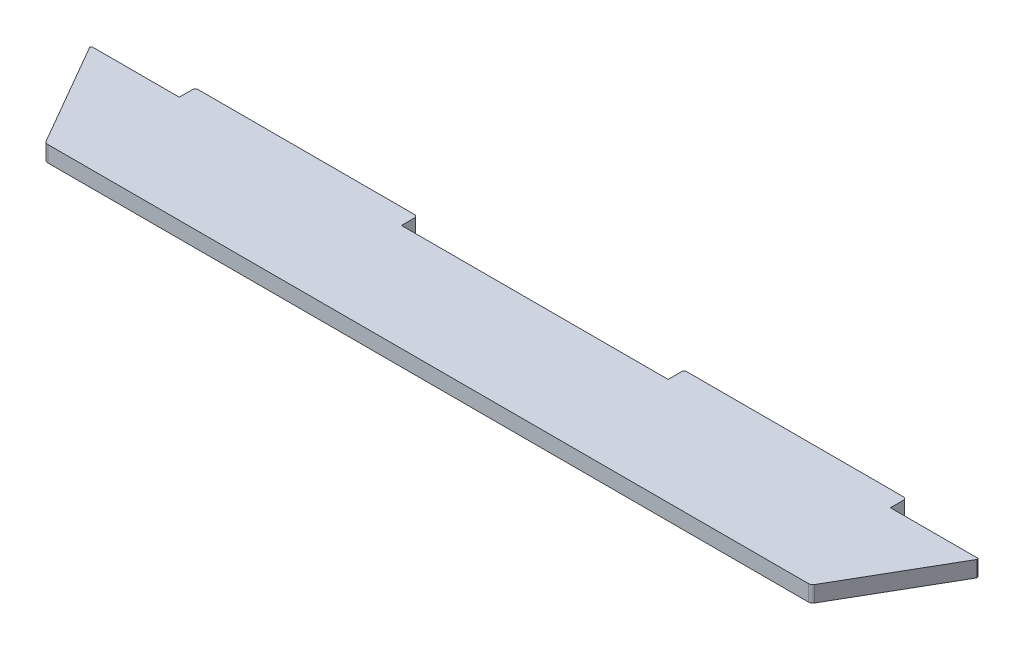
ISO-10303-21;
HEADER;
FILE_DESCRIPTION(('STEP AP214'),'2;1');
FILE_NAME('part.step','',(''),(''),'','','');
FILE_SCHEMA(('AUTOMOTIVE_DESIGN { 1 0 10303 214 1 1 1 1 }'));
ENDSEC;
DATA;
#1=APPLICATION_CONTEXT('core data for automotive mechanical design processes');
#2=APPLICATION_PROTOCOL_DEFINITION('international standard','automotive_design',2000,#1);
#3=PRODUCT_CONTEXT('',#1,'mechanical');
#4=PRODUCT('Part','Part','',(#3));
#5=PRODUCT_RELATED_PRODUCT_CATEGORY('part','',(#4));
#6=PRODUCT_DEFINITION_FORMATION('','',#4);
#7=PRODUCT_DEFINITION_CONTEXT('part definition',#1,'design');
#8=PRODUCT_DEFINITION('design','',#6,#7);
#9=PRODUCT_DEFINITION_SHAPE('','',#8);
#10=(LENGTH_UNIT() NAMED_UNIT(*) SI_UNIT(.MILLI.,.METRE.));
#11=(NAMED_UNIT(*) PLANE_ANGLE_UNIT() SI_UNIT($,.RADIAN.));
#12=(NAMED_UNIT(*) SI_UNIT($,.STERADIAN.) SOLID_ANGLE_UNIT());
#13=UNCERTAINTY_MEASURE_WITH_UNIT(LENGTH_MEASURE(1.E-05),#10,'distance_accuracy_value','');
#14=(GEOMETRIC_REPRESENTATION_CONTEXT(3) GLOBAL_UNCERTAINTY_ASSIGNED_CONTEXT((#13)) GLOBAL_UNIT_ASSIGNED_CONTEXT((#10,
#11,#12)) REPRESENTATION_CONTEXT('',''));
#15=CARTESIAN_POINT('',(0.,0.,0.));
#16=DIRECTION('',(0.,0.,1.));
#17=DIRECTION('',(1.,0.,0.));
#18=AXIS2_PLACEMENT_3D('',#15,#16,#17);
#19=CARTESIAN_POINT('',(-500.,0.,0.));
#20=DIRECTION('',(0.,0.,1.));
#21=DIRECTION('',(1.,0.,0.));
#22=AXIS2_PLACEMENT_3D('',#19,#20,#21);
#23=PLANE('',#22);
#24=DIRECTION('',(1.,0.,0.));
#25=VECTOR('',#24,1.);
#26=CARTESIAN_POINT('',(-500.,18.,0.));
#27=LINE('',#26,#25);
#28=CARTESIAN_POINT('',(-150.,18.,0.));
#29=VERTEX_POINT('',#28);
#30=CARTESIAN_POINT('',(150.,18.,0.));
#31=VERTEX_POINT('',#30);
#32=EDGE_CURVE('E182',#29,#31,#27,.T.);
#33=ORIENTED_EDGE('',*,*,#32,.T.);
#34=DIRECTION('',(0.,1.,0.));
#35=VECTOR('',#34,1.);
#36=CARTESIAN_POINT('',(150.,0.,0.));
#37=LINE('',#36,#35);
#38=CARTESIAN_POINT('',(150.,0.,0.));
#39=VERTEX_POINT('',#38);
#40=EDGE_CURVE('E195',#39,#31,#37,.T.);
#41=ORIENTED_EDGE('',*,*,#40,.F.);
#42=DIRECTION('',(1.,0.,0.));
#43=VECTOR('',#42,1.);
#44=CARTESIAN_POINT('',(-500.,0.,0.));
#45=LINE('',#44,#43);
#46=CARTESIAN_POINT('',(-150.,0.,0.));
#47=VERTEX_POINT('',#46);
#48=EDGE_CURVE('E236',#47,#39,#45,.T.);
#49=ORIENTED_EDGE('',*,*,#48,.F.);
#50=DIRECTION('',(0.,1.,0.));
#51=VECTOR('',#50,1.);
#52=CARTESIAN_POINT('',(-150.,0.,0.));
#53=LINE('',#52,#51);
#54=EDGE_CURVE('E183',#47,#29,#53,.T.);
#55=ORIENTED_EDGE('',*,*,#54,.T.);
#56=EDGE_LOOP('',(#33,#41,#49,#55));
#57=FACE_BOUND('',#56,.T.);
#58=ADVANCED_FACE('F35',(#57),#23,.F.);
#59=CARTESIAN_POINT('',(-498.,0.,0.));
#60=VERTEX_POINT('',#59);
#61=CARTESIAN_POINT('',(-400.,0.,0.));
#62=VERTEX_POINT('',#61);
#63=EDGE_CURVE('E233',#60,#62,#45,.T.);
#64=ORIENTED_EDGE('',*,*,#63,.F.);
#65=DIRECTION('',(0.,1.,0.));
#66=VECTOR('',#65,1.);
#67=CARTESIAN_POINT('',(-498.,0.,0.));
#68=LINE('',#67,#66);
#69=CARTESIAN_POINT('',(-498.,18.,0.));
#70=VERTEX_POINT('',#69);
#71=EDGE_CURVE('E284',#60,#70,#68,.T.);
#72=ORIENTED_EDGE('',*,*,#71,.T.);
#73=CARTESIAN_POINT('',(-400.,18.,0.));
#74=VERTEX_POINT('',#73);
#75=EDGE_CURVE('E185',#70,#74,#27,.T.);
#76=ORIENTED_EDGE('',*,*,#75,.T.);
#77=DIRECTION('',(0.,1.,0.));
#78=VECTOR('',#77,1.);
#79=CARTESIAN_POINT('',(-400.,0.,0.));
#80=LINE('',#79,#78);
#81=EDGE_CURVE('E223',#62,#74,#80,.T.);
#82=ORIENTED_EDGE('',*,*,#81,.F.);
#83=EDGE_LOOP('',(#64,#72,#76,#82));
#84=FACE_BOUND('',#83,.T.);
#85=ADVANCED_FACE('F377',(#84),#23,.F.);
#86=CARTESIAN_POINT('',(-500.,18.,0.));
#87=DIRECTION('',(0.866025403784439,0.,-0.5));
#88=DIRECTION('',(-0.5,0.,-0.866025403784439));
#89=AXIS2_PLACEMENT_3D('',#86,#87,#88);
#90=PLANE('',#89);
#91=DIRECTION('',(0.5,0.,0.866025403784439));
#92=VECTOR('',#91,1.);
#93=CARTESIAN_POINT('',(-500.,18.,0.));
#94=LINE('',#93,#92);
#95=CARTESIAN_POINT('',(-499.267949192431,18.,1.26794919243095));
#96=VERTEX_POINT('',#95);
#97=CARTESIAN_POINT('',(-432.161343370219,18.,117.5));
#98=VERTEX_POINT('',#97);
#99=EDGE_CURVE('E239',#96,#98,#94,.T.);
#100=ORIENTED_EDGE('',*,*,#99,.F.);
#101=DIRECTION('',(0.,-1.,0.));
#102=VECTOR('',#101,1.);
#103=CARTESIAN_POINT('',(-499.267949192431,18.,1.26794919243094));
#104=LINE('',#103,#102);
#105=CARTESIAN_POINT('',(-499.267949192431,0.,1.26794919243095));
#106=VERTEX_POINT('',#105);
#107=EDGE_CURVE('E269',#96,#106,#104,.T.);
#108=ORIENTED_EDGE('',*,*,#107,.T.);
#109=DIRECTION('',(0.5,0.,0.866025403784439));
#110=VECTOR('',#109,1.);
#111=CARTESIAN_POINT('',(-500.,0.,0.));
#112=LINE('',#111,#110);
#113=CARTESIAN_POINT('',(-432.161343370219,0.,117.5));
#114=VERTEX_POINT('',#113);
#115=EDGE_CURVE('E235',#106,#114,#112,.T.);
#116=ORIENTED_EDGE('',*,*,#115,.T.);
#117=DIRECTION('',(0.,1.,0.));
#118=VECTOR('',#117,1.);
#119=CARTESIAN_POINT('',(-432.161343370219,18.,117.5));
#120=LINE('',#119,#118);
#121=EDGE_CURVE('E250',#114,#98,#120,.T.);
#122=ORIENTED_EDGE('',*,*,#121,.T.);
#123=EDGE_LOOP('',(#100,#108,#116,#122));
#124=FACE_BOUND('',#123,.T.);
#125=ADVANCED_FACE('F382',(#124),#90,.F.);
#126=CARTESIAN_POINT('',(250.,18.,433.012701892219));
#127=DIRECTION('',(-0.866025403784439,0.,-0.5));
#128=DIRECTION('',(-0.5,0.,0.866025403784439));
#129=AXIS2_PLACEMENT_3D('',#126,#127,#128);
#130=PLANE('',#129);
#131=DIRECTION('',(0.5,0.,-0.866025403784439));
#132=VECTOR('',#131,1.);
#133=CARTESIAN_POINT('',(250.,0.,433.012701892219));
#134=LINE('',#133,#132);
#135=CARTESIAN_POINT('',(432.161343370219,0.,117.5));
#136=VERTEX_POINT('',#135);
#137=CARTESIAN_POINT('',(499.,0.,1.73205080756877));
#138=VERTEX_POINT('',#137);
#139=EDGE_CURVE('E242',#136,#138,#134,.T.);
#140=ORIENTED_EDGE('',*,*,#139,.T.);
#141=DIRECTION('',(0.,1.,0.));
#142=VECTOR('',#141,1.);
#143=CARTESIAN_POINT('',(499.,18.,1.73205080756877));
#144=LINE('',#143,#142);
#145=CARTESIAN_POINT('',(499.,18.,1.73205080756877));
#146=VERTEX_POINT('',#145);
#147=EDGE_CURVE('E298',#138,#146,#144,.T.);
#148=ORIENTED_EDGE('',*,*,#147,.T.);
#149=DIRECTION('',(0.5,0.,-0.866025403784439));
#150=VECTOR('',#149,1.);
#151=CARTESIAN_POINT('',(250.,18.,433.012701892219));
#152=LINE('',#151,#150);
#153=CARTESIAN_POINT('',(432.161343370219,18.,117.5));
#154=VERTEX_POINT('',#153);
#155=EDGE_CURVE('E241',#154,#146,#152,.T.);
#156=ORIENTED_EDGE('',*,*,#155,.F.);
#157=DIRECTION('',(0.,-1.,0.));
#158=VECTOR('',#157,1.);
#159=CARTESIAN_POINT('',(432.161343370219,18.,117.5));
#160=LINE('',#159,#158);
#161=EDGE_CURVE('E266',#154,#136,#160,.T.);
#162=ORIENTED_EDGE('',*,*,#161,.T.);
#163=EDGE_LOOP('',(#140,#148,#156,#162));
#164=FACE_BOUND('',#163,.T.);
#165=ADVANCED_FACE('F361',(#164),#130,.F.);
#166=CARTESIAN_POINT('',(0.,18.,0.));
#167=DIRECTION('',(0.,1.,0.));
#168=DIRECTION('',(0.,0.,1.));
#169=AXIS2_PLACEMENT_3D('',#166,#167,#168);
#170=PLANE('',#169);
#171=ORIENTED_EDGE('',*,*,#75,.F.);
#172=DIRECTION('',(0.707106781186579,0.,-0.707106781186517));
#173=VECTOR('',#172,1.);
#174=CARTESIAN_POINT('',(-248.999999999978,18.,-249.));
#175=LINE('',#174,#173);
#176=EDGE_CURVE('E294',#70,#96,#175,.F.);
#177=ORIENTED_EDGE('',*,*,#176,.T.);
#178=ORIENTED_EDGE('',*,*,#99,.T.);
#179=CARTESIAN_POINT('',(-427.831216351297,18.,115.));
#180=DIRECTION('',(0.,1.,0.));
#181=DIRECTION('',(0.,0.,1.));
#182=AXIS2_PLACEMENT_3D('',#179,#180,#181);
#183=CIRCLE('',#182,5.);
#184=CARTESIAN_POINT('',(-427.831216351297,18.,120.));
#185=VERTEX_POINT('',#184);
#186=EDGE_CURVE('E255',#98,#185,#183,.T.);
#187=ORIENTED_EDGE('',*,*,#186,.T.);
#188=DIRECTION('',(-1.,0.,0.));
#189=VECTOR('',#188,1.);
#190=CARTESIAN_POINT('',(-500.,18.,120.));
#191=LINE('',#190,#189);
#192=CARTESIAN_POINT('',(427.831216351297,18.,120.));
#193=VERTEX_POINT('',#192);
#194=EDGE_CURVE('E207',#193,#185,#191,.T.);
#195=ORIENTED_EDGE('',*,*,#194,.F.);
#196=CARTESIAN_POINT('',(427.831216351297,18.,115.));
#197=DIRECTION('',(0.,1.,0.));
#198=DIRECTION('',(0.,0.,1.));
#199=AXIS2_PLACEMENT_3D('',#196,#197,#198);
#200=CIRCLE('',#199,5.);
#201=EDGE_CURVE('E253',#193,#154,#200,.T.);
#202=ORIENTED_EDGE('',*,*,#201,.T.);
#203=ORIENTED_EDGE('',*,*,#155,.T.);
#204=DIRECTION('',(0.258819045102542,0.,0.965925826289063));
#205=VECTOR('',#204,1.);
#206=CARTESIAN_POINT('',(465.14032554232,18.,-124.633974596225));
#207=LINE('',#206,#205);
#208=CARTESIAN_POINT('',(498.535898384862,18.,0.));
#209=VERTEX_POINT('',#208);
#210=EDGE_CURVE('E178',#146,#209,#207,.F.);
#211=ORIENTED_EDGE('',*,*,#210,.T.);
#212=CARTESIAN_POINT('',(400.,18.,0.));
#213=VERTEX_POINT('',#212);
#214=EDGE_CURVE('E170',#213,#209,#27,.T.);
#215=ORIENTED_EDGE('',*,*,#214,.F.);
#216=DIRECTION('',(0.,0.,-1.));
#217=VECTOR('',#216,1.);
#218=CARTESIAN_POINT('',(400.,18.,0.));
#219=LINE('',#218,#217);
#220=CARTESIAN_POINT('',(400.,18.,-16.));
#221=VERTEX_POINT('',#220);
#222=EDGE_CURVE('E175',#213,#221,#219,.T.);
#223=ORIENTED_EDGE('',*,*,#222,.T.);
#224=DIRECTION('',(0.707106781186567,0.,0.707106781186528));
#225=VECTOR('',#224,1.);
#226=CARTESIAN_POINT('',(207.999999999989,18.,-208.));
#227=LINE('',#226,#225);
#228=CARTESIAN_POINT('',(398.,18.,-18.));
#229=VERTEX_POINT('',#228);
#230=EDGE_CURVE('E289',#221,#229,#227,.F.);
#231=ORIENTED_EDGE('',*,*,#230,.T.);
#232=DIRECTION('',(-1.,0.,0.));
#233=VECTOR('',#232,1.);
#234=CARTESIAN_POINT('',(150.,18.,-18.0000000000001));
#235=LINE('',#234,#233);
#236=CARTESIAN_POINT('',(152.,18.,-18.0000000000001));
#237=VERTEX_POINT('',#236);
#238=EDGE_CURVE('E201',#229,#237,#235,.T.);
#239=ORIENTED_EDGE('',*,*,#238,.T.);
#240=DIRECTION('',(0.707106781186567,0.,-0.707106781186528));
#241=VECTOR('',#240,1.);
#242=CARTESIAN_POINT('',(66.9999999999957,18.,66.9999999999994));
#243=LINE('',#242,#241);
#244=CARTESIAN_POINT('',(150.,18.,-16.0000000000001));
#245=VERTEX_POINT('',#244);
#246=EDGE_CURVE('E291',#237,#245,#243,.F.);
#247=ORIENTED_EDGE('',*,*,#246,.T.);
#248=DIRECTION('',(0.,0.,1.));
#249=VECTOR('',#248,1.);
#250=CARTESIAN_POINT('',(150.,18.,0.));
#251=LINE('',#250,#249);
#252=EDGE_CURVE('E202',#245,#31,#251,.T.);
#253=ORIENTED_EDGE('',*,*,#252,.T.);
#254=ORIENTED_EDGE('',*,*,#32,.F.);
#255=DIRECTION('',(0.,0.,-1.));
#256=VECTOR('',#255,1.);
#257=CARTESIAN_POINT('',(-150.,18.,0.));
#258=LINE('',#257,#256);
#259=CARTESIAN_POINT('',(-150.,18.,-16.0000000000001));
#260=VERTEX_POINT('',#259);
#261=EDGE_CURVE('E225',#29,#260,#258,.T.);
#262=ORIENTED_EDGE('',*,*,#261,.T.);
#263=DIRECTION('',(0.707106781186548,0.,0.707106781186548));
#264=VECTOR('',#263,1.);
#265=CARTESIAN_POINT('',(-67.,18.,67.));
#266=LINE('',#265,#264);
#267=CARTESIAN_POINT('',(-152.,18.,-18.));
#268=VERTEX_POINT('',#267);
#269=EDGE_CURVE('E287',#260,#268,#266,.F.);
#270=ORIENTED_EDGE('',*,*,#269,.T.);
#271=DIRECTION('',(-1.,0.,0.));
#272=VECTOR('',#271,1.);
#273=CARTESIAN_POINT('',(-400.,18.,-18.));
#274=LINE('',#273,#272);
#275=CARTESIAN_POINT('',(-398.,18.,-18.));
#276=VERTEX_POINT('',#275);
#277=EDGE_CURVE('E217',#268,#276,#274,.T.);
#278=ORIENTED_EDGE('',*,*,#277,.T.);
#279=DIRECTION('',(0.707106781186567,0.,-0.707106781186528));
#280=VECTOR('',#279,1.);
#281=CARTESIAN_POINT('',(-207.999999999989,18.,-208.));
#282=LINE('',#281,#280);
#283=CARTESIAN_POINT('',(-400.,18.,-16.));
#284=VERTEX_POINT('',#283);
#285=EDGE_CURVE('E50',#276,#284,#282,.F.);
#286=ORIENTED_EDGE('',*,*,#285,.T.);
#287=DIRECTION('',(0.,0.,1.));
#288=VECTOR('',#287,1.);
#289=CARTESIAN_POINT('',(-400.,18.,0.));
#290=LINE('',#289,#288);
#291=EDGE_CURVE('E194',#284,#74,#290,.T.);
#292=ORIENTED_EDGE('',*,*,#291,.T.);
#293=EDGE_LOOP('',(#171,#177,#178,#187,#195,#202,#203,#211,#215,#223,#231,#239,#247,#253,#254,
#262,#270,#278,#286,#292));
#294=FACE_BOUND('',#293,.T.);
#295=ADVANCED_FACE('F173',(#294),#170,.T.);
#296=CARTESIAN_POINT('',(0.,0.,0.));
#297=DIRECTION('',(0.,1.,0.));
#298=DIRECTION('',(0.,0.,1.));
#299=AXIS2_PLACEMENT_3D('',#296,#297,#298);
#300=PLANE('',#299);
#301=ORIENTED_EDGE('',*,*,#115,.F.);
#302=DIRECTION('',(-0.707106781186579,0.,0.707106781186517));
#303=VECTOR('',#302,1.);
#304=CARTESIAN_POINT('',(-499.267949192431,0.,1.26794919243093));
#305=LINE('',#304,#303);
#306=EDGE_CURVE('E282',#106,#60,#305,.F.);
#307=ORIENTED_EDGE('',*,*,#306,.T.);
#308=ORIENTED_EDGE('',*,*,#63,.T.);
#309=DIRECTION('',(0.,0.,1.));
#310=VECTOR('',#309,1.);
#311=CARTESIAN_POINT('',(-400.,0.,0.));
#312=LINE('',#311,#310);
#313=CARTESIAN_POINT('',(-400.,0.,-16.));
#314=VERTEX_POINT('',#313);
#315=EDGE_CURVE('E214',#314,#62,#312,.T.);
#316=ORIENTED_EDGE('',*,*,#315,.F.);
#317=DIRECTION('',(-0.707106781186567,0.,0.707106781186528));
#318=VECTOR('',#317,1.);
#319=CARTESIAN_POINT('',(-398.,0.,-18.));
#320=LINE('',#319,#318);
#321=CARTESIAN_POINT('',(-398.,0.,-18.));
#322=VERTEX_POINT('',#321);
#323=EDGE_CURVE('E272',#314,#322,#320,.F.);
#324=ORIENTED_EDGE('',*,*,#323,.T.);
#325=DIRECTION('',(-1.,0.,0.));
#326=VECTOR('',#325,1.);
#327=CARTESIAN_POINT('',(-400.,0.,-18.));
#328=LINE('',#327,#326);
#329=CARTESIAN_POINT('',(-152.,0.,-18.));
#330=VERTEX_POINT('',#329);
#331=EDGE_CURVE('E220',#330,#322,#328,.T.);
#332=ORIENTED_EDGE('',*,*,#331,.F.);
#333=DIRECTION('',(-0.707106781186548,0.,-0.707106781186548));
#334=VECTOR('',#333,1.);
#335=CARTESIAN_POINT('',(-150.,0.,-16.0000000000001));
#336=LINE('',#335,#334);
#337=CARTESIAN_POINT('',(-150.,0.,-16.0000000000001));
#338=VERTEX_POINT('',#337);
#339=EDGE_CURVE('E274',#330,#338,#336,.F.);
#340=ORIENTED_EDGE('',*,*,#339,.T.);
#341=DIRECTION('',(0.,0.,-1.));
#342=VECTOR('',#341,1.);
#343=CARTESIAN_POINT('',(-150.,0.,0.));
#344=LINE('',#343,#342);
#345=EDGE_CURVE('E216',#47,#338,#344,.T.);
#346=ORIENTED_EDGE('',*,*,#345,.F.);
#347=ORIENTED_EDGE('',*,*,#48,.T.);
#348=DIRECTION('',(0.,0.,1.));
#349=VECTOR('',#348,1.);
#350=CARTESIAN_POINT('',(150.,0.,0.));
#351=LINE('',#350,#349);
#352=CARTESIAN_POINT('',(150.,0.,-16.0000000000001));
#353=VERTEX_POINT('',#352);
#354=EDGE_CURVE('E205',#353,#39,#351,.T.);
#355=ORIENTED_EDGE('',*,*,#354,.F.);
#356=DIRECTION('',(-0.707106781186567,0.,0.707106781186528));
#357=VECTOR('',#356,1.);
#358=CARTESIAN_POINT('',(152.,0.,-18.0000000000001));
#359=LINE('',#358,#357);
#360=CARTESIAN_POINT('',(152.,0.,-18.0000000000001));
#361=VERTEX_POINT('',#360);
#362=EDGE_CURVE('E278',#353,#361,#359,.F.);
#363=ORIENTED_EDGE('',*,*,#362,.T.);
#364=DIRECTION('',(-1.,0.,0.));
#365=VECTOR('',#364,1.);
#366=CARTESIAN_POINT('',(150.,0.,-18.0000000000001));
#367=LINE('',#366,#365);
#368=CARTESIAN_POINT('',(398.,0.,-18.));
#369=VERTEX_POINT('',#368);
#370=EDGE_CURVE('E213',#369,#361,#367,.T.);
#371=ORIENTED_EDGE('',*,*,#370,.F.);
#372=DIRECTION('',(-0.707106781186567,0.,-0.707106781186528));
#373=VECTOR('',#372,1.);
#374=CARTESIAN_POINT('',(400.,0.,-16.));
#375=LINE('',#374,#373);
#376=CARTESIAN_POINT('',(400.,0.,-16.));
#377=VERTEX_POINT('',#376);
#378=EDGE_CURVE('E276',#369,#377,#375,.F.);
#379=ORIENTED_EDGE('',*,*,#378,.T.);
#380=DIRECTION('',(0.,0.,-1.));
#381=VECTOR('',#380,1.);
#382=CARTESIAN_POINT('',(400.,0.,0.));
#383=LINE('',#382,#381);
#384=CARTESIAN_POINT('',(400.,0.,0.));
#385=VERTEX_POINT('',#384);
#386=EDGE_CURVE('E341',#385,#377,#383,.T.);
#387=ORIENTED_EDGE('',*,*,#386,.F.);
#388=CARTESIAN_POINT('',(498.535898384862,0.,0.));
#389=VERTEX_POINT('',#388);
#390=EDGE_CURVE('E190',#385,#389,#45,.T.);
#391=ORIENTED_EDGE('',*,*,#390,.T.);
#392=DIRECTION('',(-0.258819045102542,0.,-0.965925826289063));
#393=VECTOR('',#392,1.);
#394=CARTESIAN_POINT('',(498.535898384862,0.,0.));
#395=LINE('',#394,#393);
#396=EDGE_CURVE('E280',#389,#138,#395,.F.);
#397=ORIENTED_EDGE('',*,*,#396,.T.);
#398=ORIENTED_EDGE('',*,*,#139,.F.);
#399=CARTESIAN_POINT('',(427.831216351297,0.,115.));
#400=DIRECTION('',(0.,1.,0.));
#401=DIRECTION('',(0.,0.,1.));
#402=AXIS2_PLACEMENT_3D('',#399,#400,#401);
#403=CIRCLE('',#402,5.);
#404=CARTESIAN_POINT('',(427.831216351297,0.,120.));
#405=VERTEX_POINT('',#404);
#406=EDGE_CURVE('E261',#136,#405,#403,.F.);
#407=ORIENTED_EDGE('',*,*,#406,.T.);
#408=DIRECTION('',(-1.,0.,0.));
#409=VECTOR('',#408,1.);
#410=CARTESIAN_POINT('',(0.,0.,120.));
#411=LINE('',#410,#409);
#412=CARTESIAN_POINT('',(-427.831216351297,0.,120.));
#413=VERTEX_POINT('',#412);
#414=EDGE_CURVE('E244',#405,#413,#411,.T.);
#415=ORIENTED_EDGE('',*,*,#414,.T.);
#416=CARTESIAN_POINT('',(-427.831216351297,0.,115.));
#417=DIRECTION('',(0.,1.,0.));
#418=DIRECTION('',(0.,0.,1.));
#419=AXIS2_PLACEMENT_3D('',#416,#417,#418);
#420=CIRCLE('',#419,5.);
#421=EDGE_CURVE('E263',#413,#114,#420,.F.);
#422=ORIENTED_EDGE('',*,*,#421,.T.);
#423=EDGE_LOOP('',(#301,#307,#308,#316,#324,#332,#340,#346,#347,#355,#363,#371,#379,#387,#391,
#397,#398,#407,#415,#422));
#424=FACE_BOUND('',#423,.T.);
#425=ADVANCED_FACE('F321',(#424),#300,.F.);
#426=ORIENTED_EDGE('',*,*,#214,.T.);
#427=DIRECTION('',(0.,-1.,0.));
#428=VECTOR('',#427,1.);
#429=CARTESIAN_POINT('',(498.535898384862,0.,0.));
#430=LINE('',#429,#428);
#431=EDGE_CURVE('E296',#209,#389,#430,.T.);
#432=ORIENTED_EDGE('',*,*,#431,.T.);
#433=ORIENTED_EDGE('',*,*,#390,.F.);
#434=DIRECTION('',(0.,1.,0.));
#435=VECTOR('',#434,1.);
#436=CARTESIAN_POINT('',(400.,0.,0.));
#437=LINE('',#436,#435);
#438=EDGE_CURVE('E187',#385,#213,#437,.T.);
#439=ORIENTED_EDGE('',*,*,#438,.T.);
#440=EDGE_LOOP('',(#426,#432,#433,#439));
#441=FACE_BOUND('',#440,.T.);
#442=ADVANCED_FACE('F188',(#441),#23,.F.);
#443=CARTESIAN_POINT('',(-400.,0.,0.));
#444=DIRECTION('',(-1.,0.,0.));
#445=DIRECTION('',(0.,0.,1.));
#446=AXIS2_PLACEMENT_3D('',#443,#444,#445);
#447=PLANE('',#446);
#448=ORIENTED_EDGE('',*,*,#291,.F.);
#449=DIRECTION('',(0.,-1.,0.));
#450=VECTOR('',#449,1.);
#451=CARTESIAN_POINT('',(-400.,0.,-16.));
#452=LINE('',#451,#450);
#453=EDGE_CURVE('E11',#284,#314,#452,.T.);
#454=ORIENTED_EDGE('',*,*,#453,.T.);
#455=ORIENTED_EDGE('',*,*,#315,.T.);
#456=ORIENTED_EDGE('',*,*,#81,.T.);
#457=EDGE_LOOP('',(#448,#454,#455,#456));
#458=FACE_BOUND('',#457,.T.);
#459=ADVANCED_FACE('F387',(#458),#447,.T.);
#460=CARTESIAN_POINT('',(-400.,0.,-18.));
#461=DIRECTION('',(0.,0.,-1.));
#462=DIRECTION('',(-1.,0.,0.));
#463=AXIS2_PLACEMENT_3D('',#460,#461,#462);
#464=PLANE('',#463);
#465=ORIENTED_EDGE('',*,*,#277,.F.);
#466=DIRECTION('',(0.,-1.,0.));
#467=VECTOR('',#466,1.);
#468=CARTESIAN_POINT('',(-152.,0.,-18.));
#469=LINE('',#468,#467);
#470=EDGE_CURVE('E43',#268,#330,#469,.T.);
#471=ORIENTED_EDGE('',*,*,#470,.T.);
#472=ORIENTED_EDGE('',*,*,#331,.T.);
#473=DIRECTION('',(0.,1.,0.));
#474=VECTOR('',#473,1.);
#475=CARTESIAN_POINT('',(-398.,0.,-18.));
#476=LINE('',#475,#474);
#477=EDGE_CURVE('E311',#322,#276,#476,.T.);
#478=ORIENTED_EDGE('',*,*,#477,.T.);
#479=EDGE_LOOP('',(#465,#471,#472,#478));
#480=FACE_BOUND('',#479,.T.);
#481=ADVANCED_FACE('F316',(#480),#464,.T.);
#482=CARTESIAN_POINT('',(-150.,0.,0.));
#483=DIRECTION('',(1.,0.,0.));
#484=DIRECTION('',(0.,0.,-1.));
#485=AXIS2_PLACEMENT_3D('',#482,#483,#484);
#486=PLANE('',#485);
#487=ORIENTED_EDGE('',*,*,#345,.T.);
#488=DIRECTION('',(0.,1.,0.));
#489=VECTOR('',#488,1.);
#490=CARTESIAN_POINT('',(-150.,0.,-16.0000000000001));
#491=LINE('',#490,#489);
#492=EDGE_CURVE('E308',#338,#260,#491,.T.);
#493=ORIENTED_EDGE('',*,*,#492,.T.);
#494=ORIENTED_EDGE('',*,*,#261,.F.);
#495=ORIENTED_EDGE('',*,*,#54,.F.);
#496=EDGE_LOOP('',(#487,#493,#494,#495));
#497=FACE_BOUND('',#496,.T.);
#498=ADVANCED_FACE('F328',(#497),#486,.T.);
#499=CARTESIAN_POINT('',(150.,0.,0.));
#500=DIRECTION('',(-1.,0.,0.));
#501=DIRECTION('',(0.,0.,1.));
#502=AXIS2_PLACEMENT_3D('',#499,#500,#501);
#503=PLANE('',#502);
#504=ORIENTED_EDGE('',*,*,#252,.F.);
#505=DIRECTION('',(0.,-1.,0.));
#506=VECTOR('',#505,1.);
#507=CARTESIAN_POINT('',(150.,0.,-16.0000000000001));
#508=LINE('',#507,#506);
#509=EDGE_CURVE('E305',#245,#353,#508,.T.);
#510=ORIENTED_EDGE('',*,*,#509,.T.);
#511=ORIENTED_EDGE('',*,*,#354,.T.);
#512=ORIENTED_EDGE('',*,*,#40,.T.);
#513=EDGE_LOOP('',(#504,#510,#511,#512));
#514=FACE_BOUND('',#513,.T.);
#515=ADVANCED_FACE('F337',(#514),#503,.T.);
#516=CARTESIAN_POINT('',(150.,0.,-18.0000000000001));
#517=DIRECTION('',(0.,0.,-1.));
#518=DIRECTION('',(-1.,0.,0.));
#519=AXIS2_PLACEMENT_3D('',#516,#517,#518);
#520=PLANE('',#519);
#521=ORIENTED_EDGE('',*,*,#370,.T.);
#522=DIRECTION('',(0.,1.,0.));
#523=VECTOR('',#522,1.);
#524=CARTESIAN_POINT('',(152.,0.,-18.0000000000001));
#525=LINE('',#524,#523);
#526=EDGE_CURVE('E302',#361,#237,#525,.T.);
#527=ORIENTED_EDGE('',*,*,#526,.T.);
#528=ORIENTED_EDGE('',*,*,#238,.F.);
#529=DIRECTION('',(0.,-1.,0.));
#530=VECTOR('',#529,1.);
#531=CARTESIAN_POINT('',(398.,0.,-18.));
#532=LINE('',#531,#530);
#533=EDGE_CURVE('E300',#229,#369,#532,.T.);
#534=ORIENTED_EDGE('',*,*,#533,.T.);
#535=EDGE_LOOP('',(#521,#527,#528,#534));
#536=FACE_BOUND('',#535,.T.);
#537=ADVANCED_FACE('F349',(#536),#520,.T.);
#538=CARTESIAN_POINT('',(400.,0.,0.));
#539=DIRECTION('',(1.,0.,0.));
#540=DIRECTION('',(0.,0.,-1.));
#541=AXIS2_PLACEMENT_3D('',#538,#539,#540);
#542=PLANE('',#541);
#543=ORIENTED_EDGE('',*,*,#386,.T.);
#544=DIRECTION('',(0.,1.,0.));
#545=VECTOR('',#544,1.);
#546=CARTESIAN_POINT('',(400.,0.,-16.));
#547=LINE('',#546,#545);
#548=EDGE_CURVE('E200',#377,#221,#547,.T.);
#549=ORIENTED_EDGE('',*,*,#548,.T.);
#550=ORIENTED_EDGE('',*,*,#222,.F.);
#551=ORIENTED_EDGE('',*,*,#438,.F.);
#552=EDGE_LOOP('',(#543,#549,#550,#551));
#553=FACE_BOUND('',#552,.T.);
#554=ADVANCED_FACE('F198',(#553),#542,.T.);
#555=CARTESIAN_POINT('',(-500.,0.,120.));
#556=DIRECTION('',(0.,0.,-1.));
#557=DIRECTION('',(-1.,0.,0.));
#558=AXIS2_PLACEMENT_3D('',#555,#556,#557);
#559=PLANE('',#558);
#560=ORIENTED_EDGE('',*,*,#194,.T.);
#561=DIRECTION('',(0.,1.,0.));
#562=VECTOR('',#561,1.);
#563=CARTESIAN_POINT('',(-427.831216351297,0.,120.));
#564=LINE('',#563,#562);
#565=EDGE_CURVE('E259',#185,#413,#564,.F.);
#566=ORIENTED_EDGE('',*,*,#565,.T.);
#567=ORIENTED_EDGE('',*,*,#414,.F.);
#568=DIRECTION('',(0.,-1.,0.));
#569=VECTOR('',#568,1.);
#570=CARTESIAN_POINT('',(427.831216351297,0.,120.));
#571=LINE('',#570,#569);
#572=EDGE_CURVE('E257',#405,#193,#571,.F.);
#573=ORIENTED_EDGE('',*,*,#572,.T.);
#574=EDGE_LOOP('',(#560,#566,#567,#573));
#575=FACE_BOUND('',#574,.T.);
#576=ADVANCED_FACE('F406',(#575),#559,.F.);
#577=CARTESIAN_POINT('',(-427.831216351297,18.,115.));
#578=DIRECTION('',(0.,1.,0.));
#579=DIRECTION('',(0.,0.,1.));
#580=AXIS2_PLACEMENT_3D('',#577,#578,#579);
#581=CYLINDRICAL_SURFACE('',#580,5.);
#582=ORIENTED_EDGE('',*,*,#421,.F.);
#583=ORIENTED_EDGE('',*,*,#565,.F.);
#584=ORIENTED_EDGE('',*,*,#186,.F.);
#585=ORIENTED_EDGE('',*,*,#121,.F.);
#586=EDGE_LOOP('',(#582,#583,#584,#585));
#587=FACE_BOUND('',#586,.T.);
#588=ADVANCED_FACE('F403',(#587),#581,.T.);
#589=CARTESIAN_POINT('',(427.831216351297,18.,115.));
#590=DIRECTION('',(0.,-1.,0.));
#591=DIRECTION('',(0.,0.,-1.));
#592=AXIS2_PLACEMENT_3D('',#589,#590,#591);
#593=CYLINDRICAL_SURFACE('',#592,5.);
#594=ORIENTED_EDGE('',*,*,#201,.F.);
#595=ORIENTED_EDGE('',*,*,#572,.F.);
#596=ORIENTED_EDGE('',*,*,#406,.F.);
#597=ORIENTED_EDGE('',*,*,#161,.F.);
#598=EDGE_LOOP('',(#594,#595,#596,#597));
#599=FACE_BOUND('',#598,.T.);
#600=ADVANCED_FACE('F373',(#599),#593,.T.);
#601=CARTESIAN_POINT('',(-499.267949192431,18.,1.26794919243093));
#602=DIRECTION('',(0.707106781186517,0.,0.707106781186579));
#603=DIRECTION('',(0.,-1.,0.));
#604=AXIS2_PLACEMENT_3D('',#601,#602,#603);
#605=PLANE('',#604);
#606=ORIENTED_EDGE('',*,*,#176,.F.);
#607=ORIENTED_EDGE('',*,*,#71,.F.);
#608=ORIENTED_EDGE('',*,*,#306,.F.);
#609=ORIENTED_EDGE('',*,*,#107,.F.);
#610=EDGE_LOOP('',(#606,#607,#608,#609));
#611=FACE_BOUND('',#610,.T.);
#612=ADVANCED_FACE('F366',(#611),#605,.F.);
#613=CARTESIAN_POINT('',(498.535898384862,0.,0.));
#614=DIRECTION('',(-0.965925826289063,0.,0.258819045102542));
#615=DIRECTION('',(0.,-1.,0.));
#616=AXIS2_PLACEMENT_3D('',#613,#614,#615);
#617=PLANE('',#616);
#618=ORIENTED_EDGE('',*,*,#210,.F.);
#619=ORIENTED_EDGE('',*,*,#147,.F.);
#620=ORIENTED_EDGE('',*,*,#396,.F.);
#621=ORIENTED_EDGE('',*,*,#431,.F.);
#622=EDGE_LOOP('',(#618,#619,#620,#621));
#623=FACE_BOUND('',#622,.T.);
#624=ADVANCED_FACE('F364',(#623),#617,.F.);
#625=CARTESIAN_POINT('',(152.,0.,-18.0000000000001));
#626=DIRECTION('',(0.707106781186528,0.,0.707106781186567));
#627=DIRECTION('',(0.,1.,0.));
#628=AXIS2_PLACEMENT_3D('',#625,#626,#627);
#629=PLANE('',#628);
#630=ORIENTED_EDGE('',*,*,#362,.F.);
#631=ORIENTED_EDGE('',*,*,#509,.F.);
#632=ORIENTED_EDGE('',*,*,#246,.F.);
#633=ORIENTED_EDGE('',*,*,#526,.F.);
#634=EDGE_LOOP('',(#630,#631,#632,#633));
#635=FACE_BOUND('',#634,.T.);
#636=ADVANCED_FACE('F354',(#635),#629,.F.);
#637=CARTESIAN_POINT('',(400.,0.,-16.));
#638=DIRECTION('',(-0.707106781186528,0.,0.707106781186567));
#639=DIRECTION('',(0.,1.,0.));
#640=AXIS2_PLACEMENT_3D('',#637,#638,#639);
#641=PLANE('',#640);
#642=ORIENTED_EDGE('',*,*,#378,.F.);
#643=ORIENTED_EDGE('',*,*,#533,.F.);
#644=ORIENTED_EDGE('',*,*,#230,.F.);
#645=ORIENTED_EDGE('',*,*,#548,.F.);
#646=EDGE_LOOP('',(#642,#643,#644,#645));
#647=FACE_BOUND('',#646,.T.);
#648=ADVANCED_FACE('F356',(#647),#641,.F.);
#649=CARTESIAN_POINT('',(-150.,0.,-16.0000000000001));
#650=DIRECTION('',(-0.707106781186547,0.,0.707106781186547));
#651=DIRECTION('',(0.,1.,0.));
#652=AXIS2_PLACEMENT_3D('',#649,#650,#651);
#653=PLANE('',#652);
#654=ORIENTED_EDGE('',*,*,#339,.F.);
#655=ORIENTED_EDGE('',*,*,#470,.F.);
#656=ORIENTED_EDGE('',*,*,#269,.F.);
#657=ORIENTED_EDGE('',*,*,#492,.F.);
#658=EDGE_LOOP('',(#654,#655,#656,#657));
#659=FACE_BOUND('',#658,.T.);
#660=ADVANCED_FACE('F326',(#659),#653,.F.);
#661=CARTESIAN_POINT('',(-398.,0.,-18.));
#662=DIRECTION('',(0.707106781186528,0.,0.707106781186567));
#663=DIRECTION('',(0.,1.,0.));
#664=AXIS2_PLACEMENT_3D('',#661,#662,#663);
#665=PLANE('',#664);
#666=ORIENTED_EDGE('',*,*,#323,.F.);
#667=ORIENTED_EDGE('',*,*,#453,.F.);
#668=ORIENTED_EDGE('',*,*,#285,.F.);
#669=ORIENTED_EDGE('',*,*,#477,.F.);
#670=EDGE_LOOP('',(#666,#667,#668,#669));
#671=FACE_BOUND('',#670,.T.);
#672=ADVANCED_FACE('F37',(#671),#665,.F.);
#673=CLOSED_SHELL('',(#58,#85,#125,#165,#295,#425,#442,#459,#481,#498,#515,#537,#554,#576,#588,
#600,#612,#624,#636,#648,#660,#672));
#674=MANIFOLD_SOLID_BREP('B2',#673);
#675=ADVANCED_BREP_SHAPE_REPRESENTATION('',(#18,#674),#14);
#676=SHAPE_DEFINITION_REPRESENTATION(#9,#675);
ENDSEC;
END-ISO-10303-21;
